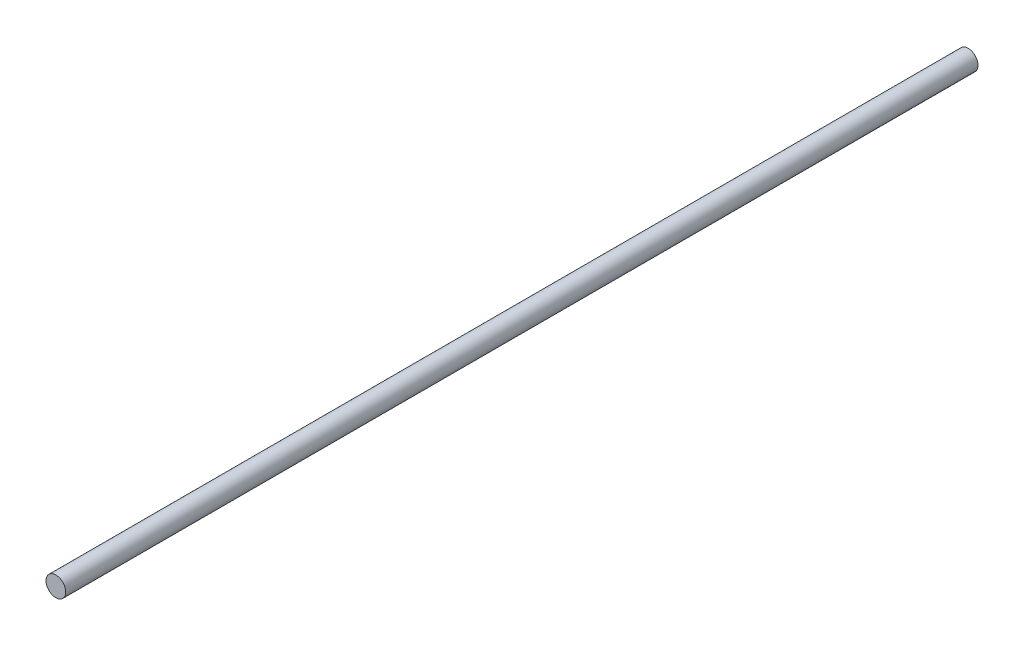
from build123d import *

# Parameters (mm, degrees)
SKETCH1_R           = 4
BOSS_EXTRUDE1_DEPTH = 370


with BuildPart() as part:
    # Sketch1 → Boss-Extrude1 (new body)
    with BuildSketch(Plane.XY):
        with Locations(Location((22.770422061, 199.902156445, 0), (0, 0, 180))):
            Circle(SKETCH1_R)
    extrude(amount=BOSS_EXTRUDE1_DEPTH)


solid = part.part
